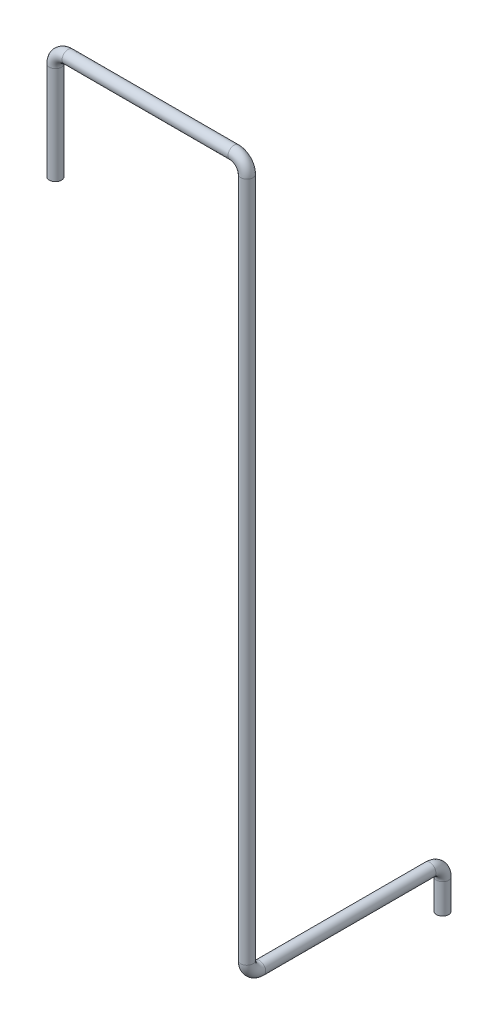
from build123d import *

# Parameters (mm, degrees)
CROQUIS1_R   = 14.3
CROQUIS1_R_2 = 12.7


with BuildPart() as part:
    # Barrer1: sweep along a curve in space
    with BuildLine() as barrer1_path:
        Line((0, 0, 0), (0, 70, 0))
        ThreePointArc((0, 70, 0), (0, 91.213203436, 8.786796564), (0, 100, 30))
        Line((0, 100, 30), (0, 100, 430))
        ThreePointArc((0, 100, 430), (0, 108.786796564, 451.213203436), (0, 130, 460))
        Line((0, 130, 460), (0, 1730, 460))
        ThreePointArc((0, 1730, 460), (-8.786796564, 1751.213203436, 460), (-30, 1760, 460))
        Line((-30, 1760, 460), (-420, 1760, 460))
        ThreePointArc((-420, 1760, 460), (-441.213203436, 1751.213203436, 460), (-450, 1730, 460))
        Line((-450, 1730, 460), (-450, 1500, 460))
    # Croquis1 → Barrer1 (sweep)
    with BuildSketch(Plane(origin=(0, 0, 0), x_dir=(1, 0, 0), z_dir=(0, 1, 0))):
        Circle(CROQUIS1_R)
        Circle(CROQUIS1_R_2, mode=Mode.SUBTRACT)
    sweep(path=barrer1_path.line)


solid = part.part
